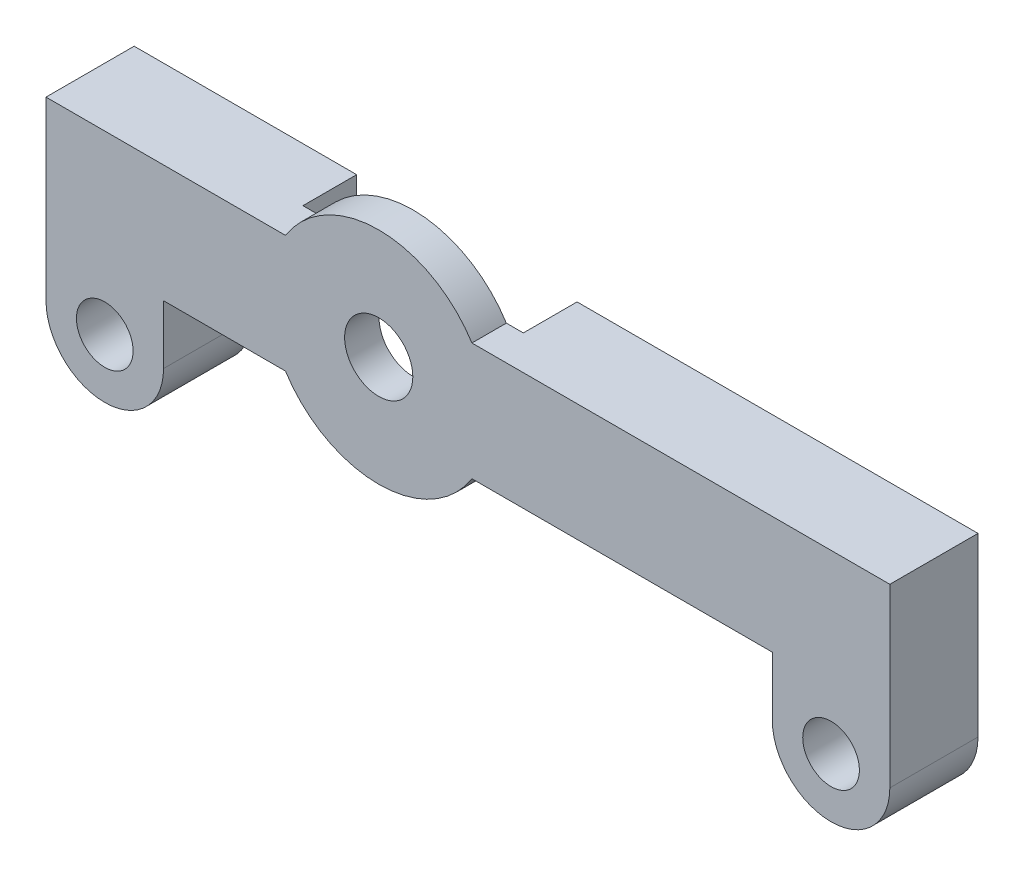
from build123d import *

# Parameters (mm, degrees)
SKETCH1_R           = 1.35
SKETCH1_R_2         = 1.625
BOSS_EXTRUDE1_DEPTH = 4.2
SKETCH2_W           = 10.5
SKETCH2_H           = 5.6
CUT_EXTRUDE1_DEPTH  = 2.56
BOSS_EXTRUDE3_START = -1.64
SKETCH3_R           = 5.25
SKETCH3_R_2         = 1.625
BOSS_EXTRUDE3_DEPTH = 1.64


with BuildPart() as part:
    # Sketch1 → Boss-Extrude1 (new body)
    with BuildSketch(Plane.XY):
        with BuildLine():
            Line((-14.5, 0), (-14.5, 2.8))
            Line((-14.5, 2.8), (14.5, 2.8))
            Line((14.5, 2.8), (14.5, 0))
            ThreePointArc((14.5, 0), (17.3, -2.8), (20.1, 0))
            Line((20.1, 0), (20.1, 8.4))
            Line((20.1, 8.4), (-20.1, 8.4))
            Line((-20.1, 8.4), (-20.1, 0))
            ThreePointArc((-20.1, 0), (-17.3, -2.8), (-14.5, 0))
        make_face()
        with Locations((-17.3, 0)):
            Circle(SKETCH1_R, mode=Mode.SUBTRACT)
        with Locations((-4.25, 5.6)):
            Circle(SKETCH1_R_2, mode=Mode.SUBTRACT)
        with Locations(Location((17.3, 0, 0), (0, 0, 180))):
            Circle(SKETCH1_R, mode=Mode.SUBTRACT)
    extrude(amount=BOSS_EXTRUDE1_DEPTH)

    # Sketch2 → Cut-Extrude1 (cut)
    with BuildSketch(Plane(origin=(0, 0, 0), x_dir=(-1, 0, 0), z_dir=(0, 0, -1))):
        with Locations((4.25, 5.6)):
            Rectangle(SKETCH2_W, SKETCH2_H)
    extrude(amount=-CUT_EXTRUDE1_DEPTH, mode=Mode.SUBTRACT)

    # Sketch3 → Boss-Extrude3 (add)
    with BuildSketch(Plane.XY.offset(4.2).offset(BOSS_EXTRUDE3_START)):
        with Locations((-4.25, 5.6)):
            Circle(SKETCH3_R)
        with Locations(Location((-4.25, 5.6, 0), (0, 0, 180))):
            Circle(SKETCH3_R_2, mode=Mode.SUBTRACT)
    extrude(amount=BOSS_EXTRUDE3_DEPTH)


solid = part.part
